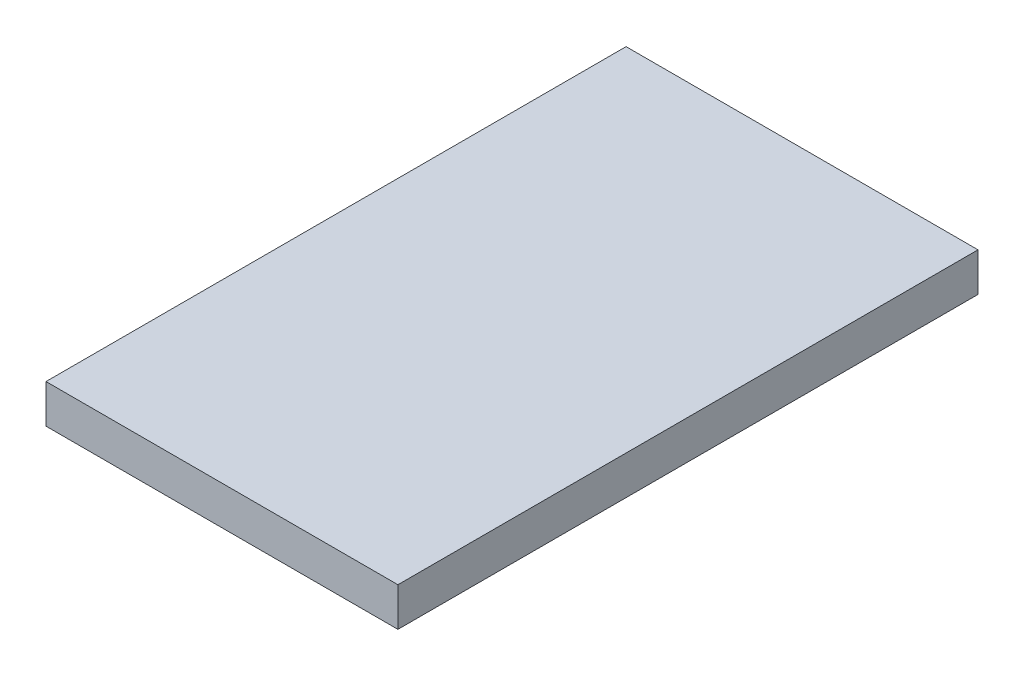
ISO-10303-21;
HEADER;
FILE_DESCRIPTION(('STEP AP214'),'2;1');
FILE_NAME('part.step','',(''),(''),'','','');
FILE_SCHEMA(('AUTOMOTIVE_DESIGN { 1 0 10303 214 1 1 1 1 }'));
ENDSEC;
DATA;
#1=APPLICATION_CONTEXT('core data for automotive mechanical design processes');
#2=APPLICATION_PROTOCOL_DEFINITION('international standard','automotive_design',2000,#1);
#3=PRODUCT_CONTEXT('',#1,'mechanical');
#4=PRODUCT('Part','Part','',(#3));
#5=PRODUCT_RELATED_PRODUCT_CATEGORY('part','',(#4));
#6=PRODUCT_DEFINITION_FORMATION('','',#4);
#7=PRODUCT_DEFINITION_CONTEXT('part definition',#1,'design');
#8=PRODUCT_DEFINITION('design','',#6,#7);
#9=PRODUCT_DEFINITION_SHAPE('','',#8);
#10=(LENGTH_UNIT() NAMED_UNIT(*) SI_UNIT(.MILLI.,.METRE.));
#11=(NAMED_UNIT(*) PLANE_ANGLE_UNIT() SI_UNIT($,.RADIAN.));
#12=(NAMED_UNIT(*) SI_UNIT($,.STERADIAN.) SOLID_ANGLE_UNIT());
#13=UNCERTAINTY_MEASURE_WITH_UNIT(LENGTH_MEASURE(1.E-05),#10,'distance_accuracy_value','');
#14=(GEOMETRIC_REPRESENTATION_CONTEXT(3) GLOBAL_UNCERTAINTY_ASSIGNED_CONTEXT((#13)) GLOBAL_UNIT_ASSIGNED_CONTEXT((#10,
#11,#12)) REPRESENTATION_CONTEXT('',''));
#15=CARTESIAN_POINT('',(0.,0.,0.));
#16=DIRECTION('',(0.,0.,1.));
#17=DIRECTION('',(1.,0.,0.));
#18=AXIS2_PLACEMENT_3D('',#15,#16,#17);
#19=CARTESIAN_POINT('',(-45.5,10.,150.));
#20=DIRECTION('',(1.,0.,0.));
#21=DIRECTION('',(0.,0.,-1.));
#22=AXIS2_PLACEMENT_3D('',#19,#20,#21);
#23=PLANE('',#22);
#24=DIRECTION('',(0.,-1.,0.));
#25=VECTOR('',#24,1.);
#26=CARTESIAN_POINT('',(-45.5,10.,0.));
#27=LINE('',#26,#25);
#28=CARTESIAN_POINT('',(-45.5,10.,0.));
#29=VERTEX_POINT('',#28);
#30=CARTESIAN_POINT('',(-45.5,0.,0.));
#31=VERTEX_POINT('',#30);
#32=EDGE_CURVE('E77',#29,#31,#27,.T.);
#33=ORIENTED_EDGE('',*,*,#32,.T.);
#34=DIRECTION('',(0.,0.,-1.));
#35=VECTOR('',#34,1.);
#36=CARTESIAN_POINT('',(-45.5,0.,150.));
#37=LINE('',#36,#35);
#38=CARTESIAN_POINT('',(-45.5,0.,150.));
#39=VERTEX_POINT('',#38);
#40=EDGE_CURVE('E11',#39,#31,#37,.T.);
#41=ORIENTED_EDGE('',*,*,#40,.F.);
#42=DIRECTION('',(0.,-1.,0.));
#43=VECTOR('',#42,1.);
#44=CARTESIAN_POINT('',(-45.5,10.,150.));
#45=LINE('',#44,#43);
#46=CARTESIAN_POINT('',(-45.5,10.,150.));
#47=VERTEX_POINT('',#46);
#48=EDGE_CURVE('E95',#47,#39,#45,.T.);
#49=ORIENTED_EDGE('',*,*,#48,.F.);
#50=DIRECTION('',(0.,0.,-1.));
#51=VECTOR('',#50,1.);
#52=CARTESIAN_POINT('',(-45.5,10.,150.));
#53=LINE('',#52,#51);
#54=EDGE_CURVE('E89',#47,#29,#53,.T.);
#55=ORIENTED_EDGE('',*,*,#54,.T.);
#56=EDGE_LOOP('',(#33,#41,#49,#55));
#57=FACE_BOUND('',#56,.T.);
#58=ADVANCED_FACE('F33',(#57),#23,.F.);
#59=CARTESIAN_POINT('',(-45.5,0.,150.));
#60=DIRECTION('',(0.,1.,0.));
#61=DIRECTION('',(0.,0.,1.));
#62=AXIS2_PLACEMENT_3D('',#59,#60,#61);
#63=PLANE('',#62);
#64=DIRECTION('',(1.,0.,0.));
#65=VECTOR('',#64,1.);
#66=CARTESIAN_POINT('',(-45.5,0.,0.));
#67=LINE('',#66,#65);
#68=CARTESIAN_POINT('',(45.5,0.,0.));
#69=VERTEX_POINT('',#68);
#70=EDGE_CURVE('E73',#31,#69,#67,.T.);
#71=ORIENTED_EDGE('',*,*,#70,.T.);
#72=DIRECTION('',(0.,0.,-1.));
#73=VECTOR('',#72,1.);
#74=CARTESIAN_POINT('',(45.5,0.,150.));
#75=LINE('',#74,#73);
#76=CARTESIAN_POINT('',(45.5,0.,150.));
#77=VERTEX_POINT('',#76);
#78=EDGE_CURVE('E40',#77,#69,#75,.T.);
#79=ORIENTED_EDGE('',*,*,#78,.F.);
#80=DIRECTION('',(1.,0.,0.));
#81=VECTOR('',#80,1.);
#82=CARTESIAN_POINT('',(-45.5,0.,150.));
#83=LINE('',#82,#81);
#84=EDGE_CURVE('E85',#39,#77,#83,.T.);
#85=ORIENTED_EDGE('',*,*,#84,.F.);
#86=ORIENTED_EDGE('',*,*,#40,.T.);
#87=EDGE_LOOP('',(#71,#79,#85,#86));
#88=FACE_BOUND('',#87,.T.);
#89=ADVANCED_FACE('F84',(#88),#63,.F.);
#90=CARTESIAN_POINT('',(45.5,10.,150.));
#91=DIRECTION('',(-1.,0.,0.));
#92=DIRECTION('',(0.,0.,1.));
#93=AXIS2_PLACEMENT_3D('',#90,#91,#92);
#94=PLANE('',#93);
#95=DIRECTION('',(0.,1.,0.));
#96=VECTOR('',#95,1.);
#97=CARTESIAN_POINT('',(45.5,10.,0.));
#98=LINE('',#97,#96);
#99=CARTESIAN_POINT('',(45.5,10.,0.));
#100=VERTEX_POINT('',#99);
#101=EDGE_CURVE('E78',#69,#100,#98,.T.);
#102=ORIENTED_EDGE('',*,*,#101,.T.);
#103=DIRECTION('',(0.,0.,-1.));
#104=VECTOR('',#103,1.);
#105=CARTESIAN_POINT('',(45.5,10.,150.));
#106=LINE('',#105,#104);
#107=CARTESIAN_POINT('',(45.5,10.,150.));
#108=VERTEX_POINT('',#107);
#109=EDGE_CURVE('E101',#108,#100,#106,.T.);
#110=ORIENTED_EDGE('',*,*,#109,.F.);
#111=DIRECTION('',(0.,1.,0.));
#112=VECTOR('',#111,1.);
#113=CARTESIAN_POINT('',(45.5,10.,150.));
#114=LINE('',#113,#112);
#115=EDGE_CURVE('E52',#77,#108,#114,.T.);
#116=ORIENTED_EDGE('',*,*,#115,.F.);
#117=ORIENTED_EDGE('',*,*,#78,.T.);
#118=EDGE_LOOP('',(#102,#110,#116,#117));
#119=FACE_BOUND('',#118,.T.);
#120=ADVANCED_FACE('F104',(#119),#94,.F.);
#121=CARTESIAN_POINT('',(-45.5,10.,150.));
#122=DIRECTION('',(0.,-1.,0.));
#123=DIRECTION('',(0.,0.,-1.));
#124=AXIS2_PLACEMENT_3D('',#121,#122,#123);
#125=PLANE('',#124);
#126=DIRECTION('',(-1.,0.,0.));
#127=VECTOR('',#126,1.);
#128=CARTESIAN_POINT('',(-45.5,10.,0.));
#129=LINE('',#128,#127);
#130=EDGE_CURVE('E93',#100,#29,#129,.T.);
#131=ORIENTED_EDGE('',*,*,#130,.T.);
#132=ORIENTED_EDGE('',*,*,#54,.F.);
#133=DIRECTION('',(-1.,0.,0.));
#134=VECTOR('',#133,1.);
#135=CARTESIAN_POINT('',(-45.5,10.,150.));
#136=LINE('',#135,#134);
#137=EDGE_CURVE('E47',#108,#47,#136,.T.);
#138=ORIENTED_EDGE('',*,*,#137,.F.);
#139=ORIENTED_EDGE('',*,*,#109,.T.);
#140=EDGE_LOOP('',(#131,#132,#138,#139));
#141=FACE_BOUND('',#140,.T.);
#142=ADVANCED_FACE('F106',(#141),#125,.F.);
#143=CARTESIAN_POINT('',(-45.5,0.,150.));
#144=DIRECTION('',(0.,0.,1.));
#145=DIRECTION('',(1.,0.,0.));
#146=AXIS2_PLACEMENT_3D('',#143,#144,#145);
#147=PLANE('',#146);
#148=ORIENTED_EDGE('',*,*,#48,.T.);
#149=ORIENTED_EDGE('',*,*,#84,.T.);
#150=ORIENTED_EDGE('',*,*,#115,.T.);
#151=ORIENTED_EDGE('',*,*,#137,.T.);
#152=EDGE_LOOP('',(#148,#149,#150,#151));
#153=FACE_BOUND('',#152,.T.);
#154=ADVANCED_FACE('F107',(#153),#147,.T.);
#155=CARTESIAN_POINT('',(-45.5,0.,0.));
#156=DIRECTION('',(0.,0.,1.));
#157=DIRECTION('',(1.,0.,0.));
#158=AXIS2_PLACEMENT_3D('',#155,#156,#157);
#159=PLANE('',#158);
#160=ORIENTED_EDGE('',*,*,#32,.F.);
#161=ORIENTED_EDGE('',*,*,#130,.F.);
#162=ORIENTED_EDGE('',*,*,#101,.F.);
#163=ORIENTED_EDGE('',*,*,#70,.F.);
#164=EDGE_LOOP('',(#160,#161,#162,#163));
#165=FACE_BOUND('',#164,.T.);
#166=ADVANCED_FACE('F74',(#165),#159,.F.);
#167=CLOSED_SHELL('',(#58,#89,#120,#142,#154,#166));
#168=MANIFOLD_SOLID_BREP('B2',#167);
#169=ADVANCED_BREP_SHAPE_REPRESENTATION('',(#18,#168),#14);
#170=SHAPE_DEFINITION_REPRESENTATION(#9,#169);
ENDSEC;
END-ISO-10303-21;
